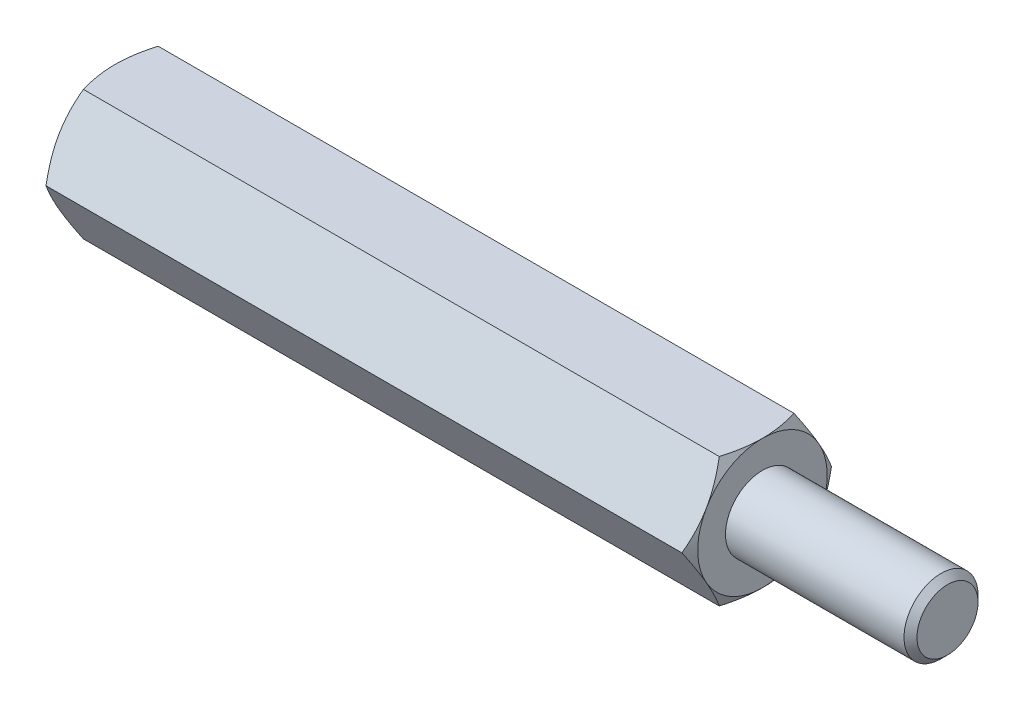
ISO-10303-21;
HEADER;
FILE_DESCRIPTION(('STEP AP214'),'2;1');
FILE_NAME('part.step','',(''),(''),'','','');
FILE_SCHEMA(('AUTOMOTIVE_DESIGN { 1 0 10303 214 1 1 1 1 }'));
ENDSEC;
DATA;
#1=APPLICATION_CONTEXT('core data for automotive mechanical design processes');
#2=APPLICATION_PROTOCOL_DEFINITION('international standard','automotive_design',2000,#1);
#3=PRODUCT_CONTEXT('',#1,'mechanical');
#4=PRODUCT('Part','Part','',(#3));
#5=PRODUCT_RELATED_PRODUCT_CATEGORY('part','',(#4));
#6=PRODUCT_DEFINITION_FORMATION('','',#4);
#7=PRODUCT_DEFINITION_CONTEXT('part definition',#1,'design');
#8=PRODUCT_DEFINITION('design','',#6,#7);
#9=PRODUCT_DEFINITION_SHAPE('','',#8);
#10=(LENGTH_UNIT() NAMED_UNIT(*) SI_UNIT(.MILLI.,.METRE.));
#11=(NAMED_UNIT(*) PLANE_ANGLE_UNIT() SI_UNIT($,.RADIAN.));
#12=(NAMED_UNIT(*) SI_UNIT($,.STERADIAN.) SOLID_ANGLE_UNIT());
#13=UNCERTAINTY_MEASURE_WITH_UNIT(LENGTH_MEASURE(1.E-05),#10,'distance_accuracy_value','');
#14=(GEOMETRIC_REPRESENTATION_CONTEXT(3) GLOBAL_UNCERTAINTY_ASSIGNED_CONTEXT((#13)) GLOBAL_UNIT_ASSIGNED_CONTEXT((#10,
#11,#12)) REPRESENTATION_CONTEXT('',''));
#15=CARTESIAN_POINT('',(0.,0.,0.));
#16=DIRECTION('',(0.,0.,1.));
#17=DIRECTION('',(1.,0.,0.));
#18=AXIS2_PLACEMENT_3D('',#15,#16,#17);
#19=CARTESIAN_POINT('',(17.5,3.5,-2.02072594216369));
#20=DIRECTION('',(1.,0.,0.));
#21=DIRECTION('',(0.,0.,-1.));
#22=AXIS2_PLACEMENT_3D('',#19,#20,#21);
#23=PLANE('',#22);
#24=CARTESIAN_POINT('',(17.5,0.,0.));
#25=DIRECTION('',(1.,0.,0.));
#26=DIRECTION('',(0.,0.,-1.));
#27=AXIS2_PLACEMENT_3D('',#24,#25,#26);
#28=CIRCLE('',#27,3.5);
#29=CARTESIAN_POINT('',(17.5,-1.75,-3.03108891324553));
#30=VERTEX_POINT('',#29);
#31=CARTESIAN_POINT('',(17.5,1.75,-3.03108891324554));
#32=VERTEX_POINT('',#31);
#33=EDGE_CURVE('E288',#30,#32,#28,.T.);
#34=ORIENTED_EDGE('',*,*,#33,.T.);
#35=CARTESIAN_POINT('',(17.5,3.5,0.));
#36=VERTEX_POINT('',#35);
#37=EDGE_CURVE('E53',#32,#36,#28,.T.);
#38=ORIENTED_EDGE('',*,*,#37,.T.);
#39=CARTESIAN_POINT('',(17.5,1.75,3.03108891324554));
#40=VERTEX_POINT('',#39);
#41=EDGE_CURVE('E297',#36,#40,#28,.T.);
#42=ORIENTED_EDGE('',*,*,#41,.T.);
#43=CARTESIAN_POINT('',(17.5,-1.75000000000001,3.03108891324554));
#44=VERTEX_POINT('',#43);
#45=EDGE_CURVE('E301',#40,#44,#28,.T.);
#46=ORIENTED_EDGE('',*,*,#45,.T.);
#47=CARTESIAN_POINT('',(17.5,0.,0.));
#48=DIRECTION('',(-1.,0.,0.));
#49=DIRECTION('',(0.,-1.,0.));
#50=AXIS2_PLACEMENT_3D('',#47,#48,#49);
#51=CIRCLE('',#50,3.5);
#52=CARTESIAN_POINT('',(17.5,-3.50000000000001,0.));
#53=VERTEX_POINT('',#52);
#54=EDGE_CURVE('E193',#53,#44,#51,.T.);
#55=ORIENTED_EDGE('',*,*,#54,.F.);
#56=EDGE_CURVE('E61',#53,#30,#28,.T.);
#57=ORIENTED_EDGE('',*,*,#56,.T.);
#58=EDGE_LOOP('',(#34,#38,#42,#46,#55,#57));
#59=FACE_BOUND('',#58,.T.);
#60=CARTESIAN_POINT('',(17.5,0.,0.));
#61=DIRECTION('',(1.,0.,0.));
#62=DIRECTION('',(0.,0.,-1.));
#63=AXIS2_PLACEMENT_3D('',#60,#61,#62);
#64=CIRCLE('',#63,2.);
#65=CARTESIAN_POINT('',(17.5,0.,-2.));
#66=VERTEX_POINT('',#65);
#67=EDGE_CURVE('E339',#66,#66,#64,.T.);
#68=ORIENTED_EDGE('',*,*,#67,.F.);
#69=EDGE_LOOP('',(#68));
#70=FACE_BOUND('',#69,.T.);
#71=ADVANCED_FACE('F37',(#59,#70),#23,.T.);
#72=CARTESIAN_POINT('',(17.5,0.,-4.04145188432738));
#73=DIRECTION('',(0.,-0.5,0.866025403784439));
#74=DIRECTION('',(0.,-0.866025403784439,-0.5));
#75=AXIS2_PLACEMENT_3D('',#72,#73,#74);
#76=PLANE('',#75);
#77=CARTESIAN_POINT('',(17.1873259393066,-0.000200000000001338,-4.04156735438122));
#78=CARTESIAN_POINT('',(17.23861421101,0.153607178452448,-3.9527667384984));
#79=CARTESIAN_POINT('',(17.2852590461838,0.308742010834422,-3.86319960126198));
#80=CARTESIAN_POINT('',(17.3666781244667,0.621698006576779,-3.68251437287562));
#81=CARTESIAN_POINT('',(17.4014235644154,0.779524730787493,-3.59139307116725));
#82=CARTESIAN_POINT('',(17.4555099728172,1.09322221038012,-3.41027974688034));
#83=CARTESIAN_POINT('',(17.4752109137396,1.24904469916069,-3.32031559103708));
#84=CARTESIAN_POINT('',(17.4987298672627,1.56142288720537,-3.13996396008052));
#85=CARTESIAN_POINT('',(17.5025673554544,1.71797745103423,-3.04957714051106));
#86=CARTESIAN_POINT('',(17.494584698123,2.01050921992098,-2.88068384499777));
#87=CARTESIAN_POINT('',(17.4847245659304,2.1465302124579,-2.80215208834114));
#88=CARTESIAN_POINT('',(17.4534735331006,2.41768602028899,-2.64560020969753));
#89=CARTESIAN_POINT('',(17.4320719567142,2.55281989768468,-2.5675806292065));
#90=CARTESIAN_POINT('',(17.3785695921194,2.82453479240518,-2.41070596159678));
#91=CARTESIAN_POINT('',(17.3462420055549,2.96108141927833,-2.33187072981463));
#92=CARTESIAN_POINT('',(17.272871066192,3.2321380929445,-2.17537608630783));
#93=CARTESIAN_POINT('',(17.2318449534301,3.36665161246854,-2.09771466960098));
#94=CARTESIAN_POINT('',(17.1873259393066,3.5002,-2.02061047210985));
#95=B_SPLINE_CURVE_WITH_KNOTS('',3,(#77,#78,#79,#80,#81,#82,#83,#84,#85,#86,#87,#88,#89,#90,#91,
#92,#93,#94),.UNSPECIFIED.,.F.,.F.,(4,2,2,2,2,2,2,2,4),(0.,0.554793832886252,1.11092123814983,
1.65328467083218,2.19498204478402,2.6666513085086,3.13875761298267,3.62133612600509,
4.10296698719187),.UNSPECIFIED.);
#96=CARTESIAN_POINT('',(17.1873926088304,0.,-4.04145188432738));
#97=VERTEX_POINT('',#96);
#98=EDGE_CURVE('E350',#97,#32,#95,.T.);
#99=ORIENTED_EDGE('',*,*,#98,.F.);
#100=DIRECTION('',(-1.,0.,0.));
#101=VECTOR('',#100,1.);
#102=CARTESIAN_POINT('',(17.5,0.,-4.04145188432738));
#103=LINE('',#102,#101);
#104=CARTESIAN_POINT('',(-17.1873926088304,0.,-4.04145188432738));
#105=VERTEX_POINT('',#104);
#106=EDGE_CURVE('E264',#97,#105,#103,.T.);
#107=ORIENTED_EDGE('',*,*,#106,.T.);
#108=CARTESIAN_POINT('',(-17.1873259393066,3.5002,-2.02061047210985));
#109=CARTESIAN_POINT('',(-17.23861421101,3.34639282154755,-2.10941108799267));
#110=CARTESIAN_POINT('',(-17.2852590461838,3.19125798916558,-2.19897822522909));
#111=CARTESIAN_POINT('',(-17.3666781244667,2.87830199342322,-2.37966345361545));
#112=CARTESIAN_POINT('',(-17.4014235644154,2.72047526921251,-2.47078475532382));
#113=CARTESIAN_POINT('',(-17.4555099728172,2.40677778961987,-2.65189807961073));
#114=CARTESIAN_POINT('',(-17.4752109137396,2.25095530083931,-2.74186223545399));
#115=CARTESIAN_POINT('',(-17.4987298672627,1.93857711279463,-2.92221386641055));
#116=CARTESIAN_POINT('',(-17.5025673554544,1.78202254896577,-3.01260068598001));
#117=CARTESIAN_POINT('',(-17.494584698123,1.48949078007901,-3.1814939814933));
#118=CARTESIAN_POINT('',(-17.4847245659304,1.3534697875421,-3.26002573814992));
#119=CARTESIAN_POINT('',(-17.4534735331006,1.08231397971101,-3.41657761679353));
#120=CARTESIAN_POINT('',(-17.4320719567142,0.947180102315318,-3.49459719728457));
#121=CARTESIAN_POINT('',(-17.3785695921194,0.675465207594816,-3.65147186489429));
#122=CARTESIAN_POINT('',(-17.3462420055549,0.538918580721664,-3.73030709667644));
#123=CARTESIAN_POINT('',(-17.272871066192,0.267861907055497,-3.88680174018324));
#124=CARTESIAN_POINT('',(-17.2318449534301,0.133348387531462,-3.96446315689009));
#125=CARTESIAN_POINT('',(-17.1873259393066,-0.000200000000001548,-4.04156735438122));
#126=B_SPLINE_CURVE_WITH_KNOTS('',3,(#108,#109,#110,#111,#112,#113,#114,#115,#116,#117,#118,
#119,#120,#121,#122,#123,#124,#125),.UNSPECIFIED.,.F.,.F.,(4,2,2,2,2,2,2,2,4),(0.,
0.554793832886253,1.11092123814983,1.65328467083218,2.19498204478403,2.6666513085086,
3.13875761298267,3.6213361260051,4.10296698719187),.UNSPECIFIED.);
#127=CARTESIAN_POINT('',(-17.5,1.75,-3.03108891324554));
#128=VERTEX_POINT('',#127);
#129=EDGE_CURVE('E317',#128,#105,#126,.T.);
#130=ORIENTED_EDGE('',*,*,#129,.F.);
#131=CARTESIAN_POINT('',(-17.1873926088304,3.5,-2.02072594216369));
#132=VERTEX_POINT('',#131);
#133=EDGE_CURVE('E320',#132,#128,#126,.T.);
#134=ORIENTED_EDGE('',*,*,#133,.F.);
#135=DIRECTION('',(-1.,0.,0.));
#136=VECTOR('',#135,1.);
#137=CARTESIAN_POINT('',(17.5,3.5,-2.02072594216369));
#138=LINE('',#137,#136);
#139=CARTESIAN_POINT('',(17.1873926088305,3.5,-2.02072594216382));
#140=VERTEX_POINT('',#139);
#141=EDGE_CURVE('E279',#140,#132,#138,.T.);
#142=ORIENTED_EDGE('',*,*,#141,.F.);
#143=EDGE_CURVE('E229',#32,#140,#95,.T.);
#144=ORIENTED_EDGE('',*,*,#143,.F.);
#145=EDGE_LOOP('',(#99,#107,#130,#134,#142,#144));
#146=FACE_BOUND('',#145,.T.);
#147=ADVANCED_FACE('F148',(#146),#76,.F.);
#148=CARTESIAN_POINT('',(17.5,3.5,-2.02072594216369));
#149=DIRECTION('',(0.,-1.,0.));
#150=DIRECTION('',(0.,0.,-1.));
#151=AXIS2_PLACEMENT_3D('',#148,#149,#150);
#152=PLANE('',#151);
#153=CARTESIAN_POINT('',(15.7443294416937,3.5,-5.525713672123));
#154=CARTESIAN_POINT('',(15.8192813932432,3.5,-5.37200190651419));
#155=CARTESIAN_POINT('',(15.893542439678,3.5,-5.21794762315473));
#156=CARTESIAN_POINT('',(16.0402960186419,3.5,-4.90897223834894));
#157=CARTESIAN_POINT('',(16.1127882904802,3.5,-4.75405101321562));
#158=CARTESIAN_POINT('',(16.2559617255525,3.5,-4.44240758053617));
#159=CARTESIAN_POINT('',(16.3266316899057,3.5,-4.28568021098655));
#160=CARTESIAN_POINT('',(16.4652074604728,3.5,-3.97101270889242));
#161=CARTESIAN_POINT('',(16.5331133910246,3.5,-3.81307263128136));
#162=CARTESIAN_POINT('',(16.6677143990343,3.5,-3.49026114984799));
#163=CARTESIAN_POINT('',(16.7342871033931,3.5,-3.32533845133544));
#164=CARTESIAN_POINT('',(16.8626267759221,3.5,-2.99359992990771));
#165=CARTESIAN_POINT('',(16.9243932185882,3.5,-2.82678390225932));
#166=CARTESIAN_POINT('',(17.0415700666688,3.5,-2.49127529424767));
#167=CARTESIAN_POINT('',(17.0969925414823,3.5,-2.32258697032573));
#168=CARTESIAN_POINT('',(17.1997679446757,3.5,-1.98279215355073));
#169=CARTESIAN_POINT('',(17.2471233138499,3.5,-1.81168640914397));
#170=CARTESIAN_POINT('',(17.3312987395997,3.5,-1.46793354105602));
#171=CARTESIAN_POINT('',(17.3681796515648,3.5,-1.2953015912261));
#172=CARTESIAN_POINT('',(17.4293955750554,3.5,-0.947791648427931));
#173=CARTESIAN_POINT('',(17.453731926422,3.5,-0.77291389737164));
#174=CARTESIAN_POINT('',(17.4876038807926,3.5,-0.424108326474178));
#175=CARTESIAN_POINT('',(17.497337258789,3.5,-0.250200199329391));
#176=CARTESIAN_POINT('',(17.5017053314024,3.5,0.0978233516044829));
#177=CARTESIAN_POINT('',(17.4963399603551,3.5,0.271938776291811));
#178=CARTESIAN_POINT('',(17.4750118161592,3.5,0.564711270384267));
#179=CARTESIAN_POINT('',(17.4628919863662,3.5,0.683667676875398));
#180=CARTESIAN_POINT('',(17.4323080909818,3.5,0.920767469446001));
#181=CARTESIAN_POINT('',(17.4138432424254,3.5,1.03891075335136));
#182=CARTESIAN_POINT('',(17.3498956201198,3.5,1.39193174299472));
#183=CARTESIAN_POINT('',(17.2958695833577,3.5,1.62528232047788));
#184=CARTESIAN_POINT('',(17.2014515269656,3.5,1.97433825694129));
#185=CARTESIAN_POINT('',(17.1672900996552,3.5,2.09183268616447));
#186=CARTESIAN_POINT('',(17.095234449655,3.5,2.32568238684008));
#187=CARTESIAN_POINT('',(17.0573401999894,3.5,2.44203765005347));
#188=CARTESIAN_POINT('',(16.9784421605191,3.5,2.6736423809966));
#189=CARTESIAN_POINT('',(16.9374392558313,3.5,2.78889215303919));
#190=CARTESIAN_POINT('',(16.852824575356,3.5,3.0184246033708));
#191=CARTESIAN_POINT('',(16.8092128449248,3.5,3.13270729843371));
#192=CARTESIAN_POINT('',(16.6958241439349,3.5,3.42150510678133));
#193=CARTESIAN_POINT('',(16.6245636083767,3.5,3.59543696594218));
#194=CARTESIAN_POINT('',(16.4781026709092,3.5,3.94163961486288));
#195=CARTESIAN_POINT('',(16.4029019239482,3.5,4.11391025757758));
#196=CARTESIAN_POINT('',(16.2494252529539,3.5,4.45713072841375));
#197=CARTESIAN_POINT('',(16.1711484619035,3.5,4.62808016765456));
#198=CARTESIAN_POINT('',(16.012188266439,3.5,4.96885843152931));
#199=CARTESIAN_POINT('',(15.9315047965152,3.5,5.13868722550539));
#200=CARTESIAN_POINT('',(15.6863871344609,3.5,5.64726192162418));
#201=CARTESIAN_POINT('',(15.5190975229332,3.5,5.98463020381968));
#202=CARTESIAN_POINT('',(15.1795854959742,3.5,6.65678495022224));
#203=CARTESIAN_POINT('',(15.0073639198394,3.5,6.99157184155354));
#204=CARTESIAN_POINT('',(14.6760800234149,3.5,7.62749570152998));
#205=CARTESIAN_POINT('',(14.5173299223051,3.5,7.92879562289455));
#206=CARTESIAN_POINT('',(14.1977473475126,3.5,8.53030635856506));
#207=CARTESIAN_POINT('',(14.0369147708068,3.5,8.83051711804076));
#208=CARTESIAN_POINT('',(13.7141792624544,3.5,9.42918006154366));
#209=CARTESIAN_POINT('',(13.5522810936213,3.5,9.72763481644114));
#210=CARTESIAN_POINT('',(13.2272737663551,3.5,10.3238577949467));
#211=CARTESIAN_POINT('',(13.0641646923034,3.5,10.6216260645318));
#212=CARTESIAN_POINT('',(12.9006104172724,3.5,10.9191478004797));
#213=B_SPLINE_CURVE_WITH_KNOTS('',3,(#153,#154,#155,#156,#157,#158,#159,#160,#161,#162,#163,
#164,#165,#166,#167,#168,#169,#170,#171,#172,#173,#174,#175,#176,#177,#178,#179,#180,#181,#182,
#183,#184,#185,#186,#187,#188,#189,#190,#191,#192,#193,#194,#195,#196,#197,#198,#199,#200,#201,
#202,#203,#204,#205,#206,#207,#208,#209,#210,#211,#212),.UNSPECIFIED.,.F.,.F.,(4,2,2,2,2,2,2,2,
2,2,2,2,2,2,2,2,2,2,2,2,2,2,2,2,2,2,2,2,2,4),(0.,0.513041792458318,1.02615874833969,
1.5419080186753,2.05763406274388,2.59113284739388,3.1246898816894,3.65721433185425,
4.18957737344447,4.71878103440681,5.247928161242,5.76984197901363,6.29175806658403,
6.65030258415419,7.00889136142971,7.72642330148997,8.0934692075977,8.46051776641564,
8.82746220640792,9.19440026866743,9.75822236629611,10.3220939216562,10.8861255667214,
11.4501725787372,12.579801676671,13.7092396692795,14.730918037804,15.7526471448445,
16.771258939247,17.7898004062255),.UNSPECIFIED.);
#214=EDGE_CURVE('E227',#140,#36,#213,.T.);
#215=ORIENTED_EDGE('',*,*,#214,.F.);
#216=ORIENTED_EDGE('',*,*,#141,.T.);
#217=CARTESIAN_POINT('',(-15.7443294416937,3.5,-5.525713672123));
#218=CARTESIAN_POINT('',(-15.8192813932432,3.5,-5.37200190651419));
#219=CARTESIAN_POINT('',(-15.893542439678,3.5,-5.21794762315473));
#220=CARTESIAN_POINT('',(-16.0402960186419,3.5,-4.90897223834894));
#221=CARTESIAN_POINT('',(-16.1127882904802,3.5,-4.75405101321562));
#222=CARTESIAN_POINT('',(-16.2559617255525,3.5,-4.44240758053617));
#223=CARTESIAN_POINT('',(-16.3266316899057,3.5,-4.28568021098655));
#224=CARTESIAN_POINT('',(-16.4652074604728,3.5,-3.97101270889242));
#225=CARTESIAN_POINT('',(-16.5331133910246,3.5,-3.81307263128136));
#226=CARTESIAN_POINT('',(-16.6677143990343,3.5,-3.49026114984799));
#227=CARTESIAN_POINT('',(-16.7342871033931,3.5,-3.32533845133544));
#228=CARTESIAN_POINT('',(-16.8626267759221,3.5,-2.99359992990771));
#229=CARTESIAN_POINT('',(-16.9243932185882,3.5,-2.82678390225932));
#230=CARTESIAN_POINT('',(-17.0415700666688,3.5,-2.49127529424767));
#231=CARTESIAN_POINT('',(-17.0969925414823,3.5,-2.32258697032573));
#232=CARTESIAN_POINT('',(-17.1997679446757,3.5,-1.98279215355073));
#233=CARTESIAN_POINT('',(-17.2471233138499,3.5,-1.81168640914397));
#234=CARTESIAN_POINT('',(-17.3312987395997,3.5,-1.46793354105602));
#235=CARTESIAN_POINT('',(-17.3681796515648,3.5,-1.2953015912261));
#236=CARTESIAN_POINT('',(-17.4293955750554,3.5,-0.947791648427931));
#237=CARTESIAN_POINT('',(-17.453731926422,3.5,-0.77291389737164));
#238=CARTESIAN_POINT('',(-17.4876038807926,3.5,-0.424108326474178));
#239=CARTESIAN_POINT('',(-17.497337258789,3.5,-0.250200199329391));
#240=CARTESIAN_POINT('',(-17.5017053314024,3.5,0.0978233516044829));
#241=CARTESIAN_POINT('',(-17.4963399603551,3.5,0.271938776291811));
#242=CARTESIAN_POINT('',(-17.4750118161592,3.5,0.564711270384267));
#243=CARTESIAN_POINT('',(-17.4628919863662,3.5,0.683667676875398));
#244=CARTESIAN_POINT('',(-17.4323080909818,3.5,0.920767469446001));
#245=CARTESIAN_POINT('',(-17.4138432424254,3.5,1.03891075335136));
#246=CARTESIAN_POINT('',(-17.3498956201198,3.5,1.39193174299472));
#247=CARTESIAN_POINT('',(-17.2958695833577,3.5,1.62528232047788));
#248=CARTESIAN_POINT('',(-17.2014515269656,3.5,1.97433825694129));
#249=CARTESIAN_POINT('',(-17.1672900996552,3.5,2.09183268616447));
#250=CARTESIAN_POINT('',(-17.095234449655,3.5,2.32568238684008));
#251=CARTESIAN_POINT('',(-17.0573401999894,3.5,2.44203765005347));
#252=CARTESIAN_POINT('',(-16.9784421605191,3.5,2.6736423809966));
#253=CARTESIAN_POINT('',(-16.9374392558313,3.5,2.78889215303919));
#254=CARTESIAN_POINT('',(-16.852824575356,3.5,3.0184246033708));
#255=CARTESIAN_POINT('',(-16.8092128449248,3.5,3.13270729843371));
#256=CARTESIAN_POINT('',(-16.6958241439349,3.5,3.42150510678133));
#257=CARTESIAN_POINT('',(-16.6245636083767,3.5,3.59543696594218));
#258=CARTESIAN_POINT('',(-16.4781026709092,3.5,3.94163961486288));
#259=CARTESIAN_POINT('',(-16.4029019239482,3.5,4.11391025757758));
#260=CARTESIAN_POINT('',(-16.2494252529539,3.5,4.45713072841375));
#261=CARTESIAN_POINT('',(-16.1711484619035,3.5,4.62808016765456));
#262=CARTESIAN_POINT('',(-16.012188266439,3.5,4.96885843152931));
#263=CARTESIAN_POINT('',(-15.9315047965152,3.5,5.13868722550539));
#264=CARTESIAN_POINT('',(-15.6863871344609,3.5,5.64726192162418));
#265=CARTESIAN_POINT('',(-15.5190975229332,3.5,5.98463020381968));
#266=CARTESIAN_POINT('',(-15.1795854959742,3.5,6.65678495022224));
#267=CARTESIAN_POINT('',(-15.0073639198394,3.5,6.99157184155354));
#268=CARTESIAN_POINT('',(-14.6760800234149,3.5,7.62749570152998));
#269=CARTESIAN_POINT('',(-14.5173299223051,3.5,7.92879562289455));
#270=CARTESIAN_POINT('',(-14.1977473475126,3.5,8.53030635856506));
#271=CARTESIAN_POINT('',(-14.0369147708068,3.5,8.83051711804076));
#272=CARTESIAN_POINT('',(-13.7141792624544,3.5,9.42918006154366));
#273=CARTESIAN_POINT('',(-13.5522810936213,3.5,9.72763481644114));
#274=CARTESIAN_POINT('',(-13.2272737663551,3.5,10.3238577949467));
#275=CARTESIAN_POINT('',(-13.0641646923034,3.5,10.6216260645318));
#276=CARTESIAN_POINT('',(-12.9006104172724,3.5,10.9191478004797));
#277=B_SPLINE_CURVE_WITH_KNOTS('',3,(#217,#218,#219,#220,#221,#222,#223,#224,#225,#226,#227,
#228,#229,#230,#231,#232,#233,#234,#235,#236,#237,#238,#239,#240,#241,#242,#243,#244,#245,#246,
#247,#248,#249,#250,#251,#252,#253,#254,#255,#256,#257,#258,#259,#260,#261,#262,#263,#264,#265,
#266,#267,#268,#269,#270,#271,#272,#273,#274,#275,#276),.UNSPECIFIED.,.F.,.F.,(4,2,2,2,2,2,2,2,
2,2,2,2,2,2,2,2,2,2,2,2,2,2,2,2,2,2,2,2,2,4),(0.,0.513041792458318,1.02615874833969,
1.5419080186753,2.05763406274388,2.59113284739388,3.1246898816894,3.65721433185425,
4.18957737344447,4.71878103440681,5.247928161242,5.76984197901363,6.29175806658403,
6.65030258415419,7.00889136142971,7.72642330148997,8.0934692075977,8.46051776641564,
8.82746220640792,9.19440026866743,9.75822236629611,10.3220939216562,10.8861255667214,
11.4501725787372,12.579801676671,13.7092396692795,14.730918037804,15.7526471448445,
16.771258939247,17.7898004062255),.UNSPECIFIED.);
#278=CARTESIAN_POINT('',(-17.5,3.5,0.));
#279=VERTEX_POINT('',#278);
#280=EDGE_CURVE('E241',#279,#132,#277,.F.);
#281=ORIENTED_EDGE('',*,*,#280,.F.);
#282=CARTESIAN_POINT('',(-17.1873926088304,3.5,2.02072594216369));
#283=VERTEX_POINT('',#282);
#284=EDGE_CURVE('E249',#283,#279,#277,.F.);
#285=ORIENTED_EDGE('',*,*,#284,.F.);
#286=DIRECTION('',(-1.,0.,0.));
#287=VECTOR('',#286,1.);
#288=CARTESIAN_POINT('',(17.5,3.5,2.02072594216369));
#289=LINE('',#288,#287);
#290=CARTESIAN_POINT('',(17.1873926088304,3.5,2.02072594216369));
#291=VERTEX_POINT('',#290);
#292=EDGE_CURVE('E276',#291,#283,#289,.T.);
#293=ORIENTED_EDGE('',*,*,#292,.F.);
#294=EDGE_CURVE('E221',#36,#291,#213,.T.);
#295=ORIENTED_EDGE('',*,*,#294,.F.);
#296=EDGE_LOOP('',(#215,#216,#281,#285,#293,#295));
#297=FACE_BOUND('',#296,.T.);
#298=ADVANCED_FACE('F153',(#297),#152,.F.);
#299=CARTESIAN_POINT('',(17.5,3.5,2.02072594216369));
#300=DIRECTION('',(0.,-0.5,-0.866025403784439));
#301=DIRECTION('',(0.,0.866025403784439,-0.5));
#302=AXIS2_PLACEMENT_3D('',#299,#300,#301);
#303=PLANE('',#302);
#304=CARTESIAN_POINT('',(17.1873259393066,3.5002,2.02061047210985));
#305=CARTESIAN_POINT('',(17.23861421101,3.34639282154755,2.10941108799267));
#306=CARTESIAN_POINT('',(17.2852590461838,3.19125798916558,2.19897822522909));
#307=CARTESIAN_POINT('',(17.3666781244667,2.87830199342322,2.37966345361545));
#308=CARTESIAN_POINT('',(17.4014235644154,2.7204752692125,2.47078475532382));
#309=CARTESIAN_POINT('',(17.4555099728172,2.40677778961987,2.65189807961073));
#310=CARTESIAN_POINT('',(17.4752109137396,2.25095530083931,2.74186223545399));
#311=CARTESIAN_POINT('',(17.4987298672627,1.93857711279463,2.92221386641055));
#312=CARTESIAN_POINT('',(17.5025673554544,1.78202254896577,3.01260068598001));
#313=CARTESIAN_POINT('',(17.494584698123,1.48949078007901,3.1814939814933));
#314=CARTESIAN_POINT('',(17.4847245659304,1.35346978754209,3.26002573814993));
#315=CARTESIAN_POINT('',(17.4534735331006,1.08231397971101,3.41657761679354));
#316=CARTESIAN_POINT('',(17.4320719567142,0.947180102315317,3.49459719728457));
#317=CARTESIAN_POINT('',(17.3785695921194,0.675465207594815,3.65147186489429));
#318=CARTESIAN_POINT('',(17.3462420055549,0.538918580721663,3.73030709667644));
#319=CARTESIAN_POINT('',(17.272871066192,0.267861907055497,3.88680174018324));
#320=CARTESIAN_POINT('',(17.2318449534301,0.133348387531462,3.96446315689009));
#321=CARTESIAN_POINT('',(17.1873259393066,-0.000200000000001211,4.04156735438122));
#322=B_SPLINE_CURVE_WITH_KNOTS('',3,(#304,#305,#306,#307,#308,#309,#310,#311,#312,#313,#314,
#315,#316,#317,#318,#319,#320,#321),.UNSPECIFIED.,.F.,.F.,(4,2,2,2,2,2,2,2,4),(0.,
0.554793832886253,1.11092123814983,1.65328467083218,2.19498204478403,2.6666513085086,
3.13875761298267,3.62133612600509,4.10296698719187),.UNSPECIFIED.);
#323=EDGE_CURVE('E228',#291,#40,#322,.T.);
#324=ORIENTED_EDGE('',*,*,#323,.F.);
#325=ORIENTED_EDGE('',*,*,#292,.T.);
#326=CARTESIAN_POINT('',(-17.1873259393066,-0.000200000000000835,4.04156735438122));
#327=CARTESIAN_POINT('',(-17.23861421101,0.153607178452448,3.9527667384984));
#328=CARTESIAN_POINT('',(-17.2852590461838,0.308742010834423,3.86319960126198));
#329=CARTESIAN_POINT('',(-17.3666781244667,0.621698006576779,3.68251437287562));
#330=CARTESIAN_POINT('',(-17.4014235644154,0.779524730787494,3.59139307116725));
#331=CARTESIAN_POINT('',(-17.4555099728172,1.09322221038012,3.41027974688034));
#332=CARTESIAN_POINT('',(-17.4752109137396,1.24904469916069,3.32031559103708));
#333=CARTESIAN_POINT('',(-17.4987298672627,1.56142288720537,3.13996396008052));
#334=CARTESIAN_POINT('',(-17.5025673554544,1.71797745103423,3.04957714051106));
#335=CARTESIAN_POINT('',(-17.494584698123,2.01050921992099,2.88068384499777));
#336=CARTESIAN_POINT('',(-17.4847245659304,2.1465302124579,2.80215208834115));
#337=CARTESIAN_POINT('',(-17.4534735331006,2.41768602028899,2.64560020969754));
#338=CARTESIAN_POINT('',(-17.4320719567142,2.55281989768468,2.5675806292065));
#339=CARTESIAN_POINT('',(-17.3785695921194,2.82453479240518,2.41070596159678));
#340=CARTESIAN_POINT('',(-17.3462420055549,2.96108141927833,2.33187072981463));
#341=CARTESIAN_POINT('',(-17.272871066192,3.2321380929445,2.17537608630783));
#342=CARTESIAN_POINT('',(-17.2318449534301,3.36665161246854,2.09771466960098));
#343=CARTESIAN_POINT('',(-17.1873259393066,3.5002,2.02061047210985));
#344=B_SPLINE_CURVE_WITH_KNOTS('',3,(#326,#327,#328,#329,#330,#331,#332,#333,#334,#335,#336,
#337,#338,#339,#340,#341,#342,#343),.UNSPECIFIED.,.F.,.F.,(4,2,2,2,2,2,2,2,4),(0.,
0.554793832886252,1.11092123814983,1.65328467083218,2.19498204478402,2.66665130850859,
3.13875761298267,3.62133612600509,4.10296698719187),.UNSPECIFIED.);
#345=CARTESIAN_POINT('',(-17.5,1.75,3.03108891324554));
#346=VERTEX_POINT('',#345);
#347=EDGE_CURVE('E255',#346,#283,#344,.T.);
#348=ORIENTED_EDGE('',*,*,#347,.F.);
#349=CARTESIAN_POINT('',(-17.1873926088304,0.,4.04145188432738));
#350=VERTEX_POINT('',#349);
#351=EDGE_CURVE('E262',#350,#346,#344,.T.);
#352=ORIENTED_EDGE('',*,*,#351,.F.);
#353=DIRECTION('',(-1.,0.,0.));
#354=VECTOR('',#353,1.);
#355=CARTESIAN_POINT('',(17.5,0.,4.04145188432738));
#356=LINE('',#355,#354);
#357=CARTESIAN_POINT('',(17.1873926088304,0.,4.04145188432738));
#358=VERTEX_POINT('',#357);
#359=EDGE_CURVE('E273',#358,#350,#356,.T.);
#360=ORIENTED_EDGE('',*,*,#359,.F.);
#361=EDGE_CURVE('E215',#40,#358,#322,.T.);
#362=ORIENTED_EDGE('',*,*,#361,.F.);
#363=EDGE_LOOP('',(#324,#325,#348,#352,#360,#362));
#364=FACE_BOUND('',#363,.T.);
#365=ADVANCED_FACE('F235',(#364),#303,.F.);
#366=CARTESIAN_POINT('',(17.5,0.,4.04145188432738));
#367=DIRECTION('',(0.,0.5,-0.866025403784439));
#368=DIRECTION('',(0.,0.866025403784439,0.5));
#369=AXIS2_PLACEMENT_3D('',#366,#367,#368);
#370=PLANE('',#369);
#371=CARTESIAN_POINT('',(17.1873259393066,0.000199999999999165,4.04156735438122));
#372=CARTESIAN_POINT('',(17.23861421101,-0.15360717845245,3.9527667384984));
#373=CARTESIAN_POINT('',(17.2852590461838,-0.308742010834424,3.86319960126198));
#374=CARTESIAN_POINT('',(17.3666781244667,-0.621698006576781,3.68251437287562));
#375=CARTESIAN_POINT('',(17.4014235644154,-0.779524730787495,3.59139307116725));
#376=CARTESIAN_POINT('',(17.4555099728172,-1.09322221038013,3.41027974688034));
#377=CARTESIAN_POINT('',(17.4752109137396,-1.24904469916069,3.32031559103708));
#378=CARTESIAN_POINT('',(17.4987298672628,-1.56142288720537,3.13996396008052));
#379=CARTESIAN_POINT('',(17.5025673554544,-1.71797745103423,3.04957714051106));
#380=CARTESIAN_POINT('',(17.494584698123,-2.01050921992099,2.88068384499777));
#381=CARTESIAN_POINT('',(17.4847245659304,-2.1465302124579,2.80215208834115));
#382=CARTESIAN_POINT('',(17.4534735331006,-2.41768602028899,2.64560020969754));
#383=CARTESIAN_POINT('',(17.4320719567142,-2.55281989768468,2.5675806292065));
#384=CARTESIAN_POINT('',(17.3785695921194,-2.82453479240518,2.41070596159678));
#385=CARTESIAN_POINT('',(17.3462420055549,-2.96108141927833,2.33187072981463));
#386=CARTESIAN_POINT('',(17.272871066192,-3.2321380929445,2.17537608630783));
#387=CARTESIAN_POINT('',(17.2318449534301,-3.36665161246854,2.09771466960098));
#388=CARTESIAN_POINT('',(17.1873259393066,-3.5002,2.02061047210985));
#389=B_SPLINE_CURVE_WITH_KNOTS('',3,(#371,#372,#373,#374,#375,#376,#377,#378,#379,#380,#381,
#382,#383,#384,#385,#386,#387,#388),.UNSPECIFIED.,.F.,.F.,(4,2,2,2,2,2,2,2,4),(0.,
0.554793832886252,1.11092123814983,1.65328467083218,2.19498204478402,2.66665130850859,
3.13875761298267,3.62133612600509,4.10296698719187),.UNSPECIFIED.);
#390=EDGE_CURVE('E324',#358,#44,#389,.T.);
#391=ORIENTED_EDGE('',*,*,#390,.F.);
#392=ORIENTED_EDGE('',*,*,#359,.T.);
#393=CARTESIAN_POINT('',(-17.1873259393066,-3.5002,2.02061047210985));
#394=CARTESIAN_POINT('',(-17.23861421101,-3.34639282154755,2.10941108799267));
#395=CARTESIAN_POINT('',(-17.2852590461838,-3.19125798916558,2.19897822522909));
#396=CARTESIAN_POINT('',(-17.3666781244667,-2.87830199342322,2.37966345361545));
#397=CARTESIAN_POINT('',(-17.4014235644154,-2.72047526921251,2.47078475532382));
#398=CARTESIAN_POINT('',(-17.4555099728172,-2.40677778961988,2.65189807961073));
#399=CARTESIAN_POINT('',(-17.4752109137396,-2.25095530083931,2.74186223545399));
#400=CARTESIAN_POINT('',(-17.4987298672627,-1.93857711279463,2.92221386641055));
#401=CARTESIAN_POINT('',(-17.5025673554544,-1.78202254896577,3.01260068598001));
#402=CARTESIAN_POINT('',(-17.494584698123,-1.48949078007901,3.1814939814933));
#403=CARTESIAN_POINT('',(-17.4847245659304,-1.3534697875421,3.26002573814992));
#404=CARTESIAN_POINT('',(-17.4534735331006,-1.08231397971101,3.41657761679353));
#405=CARTESIAN_POINT('',(-17.4320719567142,-0.94718010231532,3.49459719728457));
#406=CARTESIAN_POINT('',(-17.3785695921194,-0.675465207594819,3.65147186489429));
#407=CARTESIAN_POINT('',(-17.3462420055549,-0.538918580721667,3.73030709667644));
#408=CARTESIAN_POINT('',(-17.272871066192,-0.2678619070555,3.88680174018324));
#409=CARTESIAN_POINT('',(-17.2318449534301,-0.133348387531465,3.96446315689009));
#410=CARTESIAN_POINT('',(-17.1873259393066,0.000199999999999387,4.04156735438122));
#411=B_SPLINE_CURVE_WITH_KNOTS('',3,(#393,#394,#395,#396,#397,#398,#399,#400,#401,#402,#403,
#404,#405,#406,#407,#408,#409,#410),.UNSPECIFIED.,.F.,.F.,(4,2,2,2,2,2,2,2,4),(0.,
0.554793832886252,1.11092123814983,1.65328467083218,2.19498204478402,2.66665130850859,
3.13875761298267,3.62133612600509,4.10296698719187),.UNSPECIFIED.);
#412=CARTESIAN_POINT('',(-17.5,-1.75000000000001,3.03108891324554));
#413=VERTEX_POINT('',#412);
#414=EDGE_CURVE('E263',#413,#350,#411,.T.);
#415=ORIENTED_EDGE('',*,*,#414,.F.);
#416=CARTESIAN_POINT('',(-17.1873926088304,-3.5,2.02072594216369));
#417=VERTEX_POINT('',#416);
#418=EDGE_CURVE('E250',#417,#413,#411,.T.);
#419=ORIENTED_EDGE('',*,*,#418,.F.);
#420=DIRECTION('',(-1.,0.,0.));
#421=VECTOR('',#420,1.);
#422=CARTESIAN_POINT('',(17.5,-3.5,2.02072594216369));
#423=LINE('',#422,#421);
#424=CARTESIAN_POINT('',(17.1873926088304,-3.5,2.02072594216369));
#425=VERTEX_POINT('',#424);
#426=EDGE_CURVE('E270',#425,#417,#423,.T.);
#427=ORIENTED_EDGE('',*,*,#426,.F.);
#428=EDGE_CURVE('E210',#44,#425,#389,.T.);
#429=ORIENTED_EDGE('',*,*,#428,.F.);
#430=EDGE_LOOP('',(#391,#392,#415,#419,#427,#429));
#431=FACE_BOUND('',#430,.T.);
#432=ADVANCED_FACE('F396',(#431),#370,.F.);
#433=CARTESIAN_POINT('',(17.5,-3.5,2.02072594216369));
#434=DIRECTION('',(0.,1.,0.));
#435=DIRECTION('',(0.,0.,1.));
#436=AXIS2_PLACEMENT_3D('',#433,#434,#435);
#437=PLANE('',#436);
#438=CARTESIAN_POINT('',(15.7443294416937,-3.5,-5.52571367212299));
#439=CARTESIAN_POINT('',(15.8192813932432,-3.5,-5.37200190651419));
#440=CARTESIAN_POINT('',(15.893542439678,-3.5,-5.21794762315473));
#441=CARTESIAN_POINT('',(16.0402960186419,-3.5,-4.90897223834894));
#442=CARTESIAN_POINT('',(16.1127882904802,-3.5,-4.75405101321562));
#443=CARTESIAN_POINT('',(16.2559617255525,-3.5,-4.44240758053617));
#444=CARTESIAN_POINT('',(16.3266316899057,-3.5,-4.28568021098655));
#445=CARTESIAN_POINT('',(16.4652074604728,-3.5,-3.97101270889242));
#446=CARTESIAN_POINT('',(16.5331133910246,-3.5,-3.81307263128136));
#447=CARTESIAN_POINT('',(16.6677143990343,-3.5,-3.49026114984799));
#448=CARTESIAN_POINT('',(16.7342871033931,-3.5,-3.32533845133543));
#449=CARTESIAN_POINT('',(16.8626267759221,-3.5,-2.99359992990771));
#450=CARTESIAN_POINT('',(16.9243932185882,-3.5,-2.82678390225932));
#451=CARTESIAN_POINT('',(17.0415700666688,-3.5,-2.49127529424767));
#452=CARTESIAN_POINT('',(17.0969925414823,-3.5,-2.32258697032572));
#453=CARTESIAN_POINT('',(17.1997679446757,-3.5,-1.98279215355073));
#454=CARTESIAN_POINT('',(17.2471233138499,-3.5,-1.81168640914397));
#455=CARTESIAN_POINT('',(17.3312987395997,-3.5,-1.46793354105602));
#456=CARTESIAN_POINT('',(17.3681796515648,-3.5,-1.2953015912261));
#457=CARTESIAN_POINT('',(17.4293955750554,-3.5,-0.947791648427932));
#458=CARTESIAN_POINT('',(17.453731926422,-3.5,-0.772913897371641));
#459=CARTESIAN_POINT('',(17.4876038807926,-3.5,-0.424108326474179));
#460=CARTESIAN_POINT('',(17.497337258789,-3.5,-0.250200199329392));
#461=CARTESIAN_POINT('',(17.5017053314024,-3.5,0.0978233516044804));
#462=CARTESIAN_POINT('',(17.4963399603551,-3.5,0.271938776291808));
#463=CARTESIAN_POINT('',(17.4750118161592,-3.5,0.564711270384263));
#464=CARTESIAN_POINT('',(17.4628919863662,-3.5,0.683667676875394));
#465=CARTESIAN_POINT('',(17.4323080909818,-3.5,0.920767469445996));
#466=CARTESIAN_POINT('',(17.4138432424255,-3.5,1.03891075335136));
#467=CARTESIAN_POINT('',(17.3498956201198,-3.5,1.39193174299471));
#468=CARTESIAN_POINT('',(17.2958695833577,-3.5,1.62528232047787));
#469=CARTESIAN_POINT('',(17.2014515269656,-3.5,1.97433825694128));
#470=CARTESIAN_POINT('',(17.1672900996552,-3.5,2.09183268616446));
#471=CARTESIAN_POINT('',(17.095234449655,-3.5,2.32568238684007));
#472=CARTESIAN_POINT('',(17.0573401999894,-3.5,2.44203765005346));
#473=CARTESIAN_POINT('',(16.9784421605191,-3.5,2.67364238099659));
#474=CARTESIAN_POINT('',(16.9374392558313,-3.5,2.78889215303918));
#475=CARTESIAN_POINT('',(16.852824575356,-3.5,3.01842460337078));
#476=CARTESIAN_POINT('',(16.8092128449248,-3.5,3.1327072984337));
#477=CARTESIAN_POINT('',(16.6958241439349,-3.5,3.42150510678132));
#478=CARTESIAN_POINT('',(16.6245636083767,-3.5,3.59543696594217));
#479=CARTESIAN_POINT('',(16.4781026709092,-3.5,3.94163961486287));
#480=CARTESIAN_POINT('',(16.4029019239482,-3.5,4.11391025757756));
#481=CARTESIAN_POINT('',(16.2494252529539,-3.5,4.45713072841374));
#482=CARTESIAN_POINT('',(16.1711484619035,-3.5,4.62808016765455));
#483=CARTESIAN_POINT('',(16.0121882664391,-3.5,4.9688584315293));
#484=CARTESIAN_POINT('',(15.9315047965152,-3.5,5.13868722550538));
#485=CARTESIAN_POINT('',(15.6863871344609,-3.5,5.64726192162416));
#486=CARTESIAN_POINT('',(15.5190975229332,-3.5,5.98463020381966));
#487=CARTESIAN_POINT('',(15.1795854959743,-3.5,6.65678495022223));
#488=CARTESIAN_POINT('',(15.0073639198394,-3.5,6.99157184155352));
#489=CARTESIAN_POINT('',(14.6760800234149,-3.5,7.62749570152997));
#490=CARTESIAN_POINT('',(14.5173299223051,-3.5,7.92879562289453));
#491=CARTESIAN_POINT('',(14.1977473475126,-3.5,8.53030635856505));
#492=CARTESIAN_POINT('',(14.0369147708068,-3.5,8.83051711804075));
#493=CARTESIAN_POINT('',(13.7141792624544,-3.5,9.42918006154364));
#494=CARTESIAN_POINT('',(13.5522810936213,-3.5,9.72763481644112));
#495=CARTESIAN_POINT('',(13.2272737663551,-3.5,10.3238577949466));
#496=CARTESIAN_POINT('',(13.0641646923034,-3.5,10.6216260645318));
#497=CARTESIAN_POINT('',(12.9006104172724,-3.5,10.9191478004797));
#498=B_SPLINE_CURVE_WITH_KNOTS('',3,(#438,#439,#440,#441,#442,#443,#444,#445,#446,#447,#448,
#449,#450,#451,#452,#453,#454,#455,#456,#457,#458,#459,#460,#461,#462,#463,#464,#465,#466,#467,
#468,#469,#470,#471,#472,#473,#474,#475,#476,#477,#478,#479,#480,#481,#482,#483,#484,#485,#486,
#487,#488,#489,#490,#491,#492,#493,#494,#495,#496,#497),.UNSPECIFIED.,.F.,.F.,(4,2,2,2,2,2,2,2,
2,2,2,2,2,2,2,2,2,2,2,2,2,2,2,2,2,2,2,2,2,4),(0.,0.513041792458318,1.02615874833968,
1.5419080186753,2.05763406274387,2.59113284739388,3.1246898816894,3.65721433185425,
4.18957737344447,4.71878103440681,5.247928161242,5.76984197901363,6.29175806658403,
6.65030258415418,7.0088913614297,7.72642330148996,8.09346920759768,8.46051776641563,
8.8274622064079,9.19440026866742,9.75822236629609,10.3220939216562,10.8861255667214,
11.4501725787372,12.579801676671,13.7092396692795,14.730918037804,15.7526471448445,
16.7712589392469,17.7898004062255),.UNSPECIFIED.);
#499=EDGE_CURVE('E322',#425,#53,#498,.F.);
#500=ORIENTED_EDGE('',*,*,#499,.F.);
#501=ORIENTED_EDGE('',*,*,#426,.T.);
#502=CARTESIAN_POINT('',(-15.7443294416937,-3.5,-5.52571367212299));
#503=CARTESIAN_POINT('',(-15.8192813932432,-3.5,-5.37200190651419));
#504=CARTESIAN_POINT('',(-15.893542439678,-3.5,-5.21794762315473));
#505=CARTESIAN_POINT('',(-16.0402960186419,-3.5,-4.90897223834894));
#506=CARTESIAN_POINT('',(-16.1127882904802,-3.5,-4.75405101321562));
#507=CARTESIAN_POINT('',(-16.2559617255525,-3.5,-4.44240758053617));
#508=CARTESIAN_POINT('',(-16.3266316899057,-3.5,-4.28568021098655));
#509=CARTESIAN_POINT('',(-16.4652074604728,-3.5,-3.97101270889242));
#510=CARTESIAN_POINT('',(-16.5331133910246,-3.5,-3.81307263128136));
#511=CARTESIAN_POINT('',(-16.6677143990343,-3.5,-3.49026114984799));
#512=CARTESIAN_POINT('',(-16.7342871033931,-3.5,-3.32533845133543));
#513=CARTESIAN_POINT('',(-16.8626267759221,-3.5,-2.99359992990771));
#514=CARTESIAN_POINT('',(-16.9243932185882,-3.5,-2.82678390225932));
#515=CARTESIAN_POINT('',(-17.0415700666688,-3.5,-2.49127529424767));
#516=CARTESIAN_POINT('',(-17.0969925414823,-3.5,-2.32258697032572));
#517=CARTESIAN_POINT('',(-17.1997679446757,-3.5,-1.98279215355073));
#518=CARTESIAN_POINT('',(-17.2471233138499,-3.5,-1.81168640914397));
#519=CARTESIAN_POINT('',(-17.3312987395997,-3.5,-1.46793354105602));
#520=CARTESIAN_POINT('',(-17.3681796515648,-3.5,-1.2953015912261));
#521=CARTESIAN_POINT('',(-17.4293955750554,-3.5,-0.947791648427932));
#522=CARTESIAN_POINT('',(-17.453731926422,-3.5,-0.772913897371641));
#523=CARTESIAN_POINT('',(-17.4876038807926,-3.5,-0.424108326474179));
#524=CARTESIAN_POINT('',(-17.497337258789,-3.5,-0.250200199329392));
#525=CARTESIAN_POINT('',(-17.5017053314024,-3.5,0.0978233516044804));
#526=CARTESIAN_POINT('',(-17.4963399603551,-3.5,0.271938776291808));
#527=CARTESIAN_POINT('',(-17.4750118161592,-3.5,0.564711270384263));
#528=CARTESIAN_POINT('',(-17.4628919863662,-3.5,0.683667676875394));
#529=CARTESIAN_POINT('',(-17.4323080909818,-3.5,0.920767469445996));
#530=CARTESIAN_POINT('',(-17.4138432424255,-3.5,1.03891075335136));
#531=CARTESIAN_POINT('',(-17.3498956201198,-3.5,1.39193174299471));
#532=CARTESIAN_POINT('',(-17.2958695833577,-3.5,1.62528232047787));
#533=CARTESIAN_POINT('',(-17.2014515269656,-3.5,1.97433825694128));
#534=CARTESIAN_POINT('',(-17.1672900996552,-3.5,2.09183268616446));
#535=CARTESIAN_POINT('',(-17.095234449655,-3.5,2.32568238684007));
#536=CARTESIAN_POINT('',(-17.0573401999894,-3.5,2.44203765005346));
#537=CARTESIAN_POINT('',(-16.9784421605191,-3.5,2.67364238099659));
#538=CARTESIAN_POINT('',(-16.9374392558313,-3.5,2.78889215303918));
#539=CARTESIAN_POINT('',(-16.852824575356,-3.5,3.01842460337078));
#540=CARTESIAN_POINT('',(-16.8092128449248,-3.5,3.1327072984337));
#541=CARTESIAN_POINT('',(-16.6958241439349,-3.5,3.42150510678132));
#542=CARTESIAN_POINT('',(-16.6245636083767,-3.5,3.59543696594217));
#543=CARTESIAN_POINT('',(-16.4781026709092,-3.5,3.94163961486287));
#544=CARTESIAN_POINT('',(-16.4029019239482,-3.5,4.11391025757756));
#545=CARTESIAN_POINT('',(-16.2494252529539,-3.5,4.45713072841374));
#546=CARTESIAN_POINT('',(-16.1711484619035,-3.5,4.62808016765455));
#547=CARTESIAN_POINT('',(-16.0121882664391,-3.5,4.9688584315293));
#548=CARTESIAN_POINT('',(-15.9315047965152,-3.5,5.13868722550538));
#549=CARTESIAN_POINT('',(-15.6863871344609,-3.5,5.64726192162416));
#550=CARTESIAN_POINT('',(-15.5190975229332,-3.5,5.98463020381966));
#551=CARTESIAN_POINT('',(-15.1795854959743,-3.5,6.65678495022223));
#552=CARTESIAN_POINT('',(-15.0073639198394,-3.5,6.99157184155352));
#553=CARTESIAN_POINT('',(-14.6760800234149,-3.5,7.62749570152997));
#554=CARTESIAN_POINT('',(-14.5173299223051,-3.5,7.92879562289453));
#555=CARTESIAN_POINT('',(-14.1977473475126,-3.5,8.53030635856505));
#556=CARTESIAN_POINT('',(-14.0369147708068,-3.5,8.83051711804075));
#557=CARTESIAN_POINT('',(-13.7141792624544,-3.5,9.42918006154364));
#558=CARTESIAN_POINT('',(-13.5522810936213,-3.5,9.72763481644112));
#559=CARTESIAN_POINT('',(-13.2272737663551,-3.5,10.3238577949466));
#560=CARTESIAN_POINT('',(-13.0641646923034,-3.5,10.6216260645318));
#561=CARTESIAN_POINT('',(-12.9006104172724,-3.5,10.9191478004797));
#562=B_SPLINE_CURVE_WITH_KNOTS('',3,(#502,#503,#504,#505,#506,#507,#508,#509,#510,#511,#512,
#513,#514,#515,#516,#517,#518,#519,#520,#521,#522,#523,#524,#525,#526,#527,#528,#529,#530,#531,
#532,#533,#534,#535,#536,#537,#538,#539,#540,#541,#542,#543,#544,#545,#546,#547,#548,#549,#550,
#551,#552,#553,#554,#555,#556,#557,#558,#559,#560,#561),.UNSPECIFIED.,.F.,.F.,(4,2,2,2,2,2,2,2,
2,2,2,2,2,2,2,2,2,2,2,2,2,2,2,2,2,2,2,2,2,4),(0.,0.513041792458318,1.02615874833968,
1.5419080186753,2.05763406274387,2.59113284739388,3.1246898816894,3.65721433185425,
4.18957737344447,4.71878103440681,5.247928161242,5.76984197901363,6.29175806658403,
6.65030258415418,7.0088913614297,7.72642330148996,8.09346920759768,8.46051776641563,
8.8274622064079,9.19440026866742,9.75822236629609,10.3220939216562,10.8861255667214,
11.4501725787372,12.579801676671,13.7092396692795,14.730918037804,15.7526471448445,
16.7712589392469,17.7898004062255),.UNSPECIFIED.);
#563=CARTESIAN_POINT('',(-17.5,-3.50000000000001,0.));
#564=VERTEX_POINT('',#563);
#565=EDGE_CURVE('E314',#564,#417,#562,.T.);
#566=ORIENTED_EDGE('',*,*,#565,.F.);
#567=CARTESIAN_POINT('',(-17.1873926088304,-3.5,-2.02072594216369));
#568=VERTEX_POINT('',#567);
#569=EDGE_CURVE('E321',#568,#564,#562,.T.);
#570=ORIENTED_EDGE('',*,*,#569,.F.);
#571=DIRECTION('',(-1.,0.,0.));
#572=VECTOR('',#571,1.);
#573=CARTESIAN_POINT('',(17.5,-3.5,-2.02072594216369));
#574=LINE('',#573,#572);
#575=CARTESIAN_POINT('',(17.1873926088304,-3.5,-2.02072594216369));
#576=VERTEX_POINT('',#575);
#577=EDGE_CURVE('E267',#576,#568,#574,.T.);
#578=ORIENTED_EDGE('',*,*,#577,.F.);
#579=EDGE_CURVE('E195',#53,#576,#498,.F.);
#580=ORIENTED_EDGE('',*,*,#579,.F.);
#581=EDGE_LOOP('',(#500,#501,#566,#570,#578,#580));
#582=FACE_BOUND('',#581,.T.);
#583=ADVANCED_FACE('F172',(#582),#437,.F.);
#584=CARTESIAN_POINT('',(17.5,-3.5,-2.02072594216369));
#585=DIRECTION('',(0.,0.5,0.866025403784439));
#586=DIRECTION('',(0.,-0.866025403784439,0.5));
#587=AXIS2_PLACEMENT_3D('',#584,#585,#586);
#588=PLANE('',#587);
#589=CARTESIAN_POINT('',(17.1873259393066,-3.5002,-2.02061047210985));
#590=CARTESIAN_POINT('',(17.23861421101,-3.34639282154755,-2.10941108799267));
#591=CARTESIAN_POINT('',(17.2852590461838,-3.19125798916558,-2.19897822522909));
#592=CARTESIAN_POINT('',(17.3666781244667,-2.87830199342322,-2.37966345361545));
#593=CARTESIAN_POINT('',(17.4014235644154,-2.72047526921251,-2.47078475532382));
#594=CARTESIAN_POINT('',(17.4555099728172,-2.40677778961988,-2.65189807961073));
#595=CARTESIAN_POINT('',(17.4752109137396,-2.25095530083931,-2.74186223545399));
#596=CARTESIAN_POINT('',(17.4987298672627,-1.93857711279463,-2.92221386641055));
#597=CARTESIAN_POINT('',(17.5025673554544,-1.78202254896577,-3.01260068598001));
#598=CARTESIAN_POINT('',(17.494584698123,-1.48949078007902,-3.1814939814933));
#599=CARTESIAN_POINT('',(17.4847245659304,-1.3534697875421,-3.26002573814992));
#600=CARTESIAN_POINT('',(17.4534735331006,-1.08231397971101,-3.41657761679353));
#601=CARTESIAN_POINT('',(17.4320719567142,-0.94718010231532,-3.49459719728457));
#602=CARTESIAN_POINT('',(17.3785695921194,-0.675465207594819,-3.65147186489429));
#603=CARTESIAN_POINT('',(17.3462420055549,-0.538918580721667,-3.73030709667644));
#604=CARTESIAN_POINT('',(17.272871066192,-0.2678619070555,-3.88680174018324));
#605=CARTESIAN_POINT('',(17.2318449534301,-0.133348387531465,-3.96446315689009));
#606=CARTESIAN_POINT('',(17.1873259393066,0.000199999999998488,-4.04156735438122));
#607=B_SPLINE_CURVE_WITH_KNOTS('',3,(#589,#590,#591,#592,#593,#594,#595,#596,#597,#598,#599,
#600,#601,#602,#603,#604,#605,#606),.UNSPECIFIED.,.F.,.F.,(4,2,2,2,2,2,2,2,4),(0.,
0.554793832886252,1.11092123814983,1.65328467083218,2.19498204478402,2.66665130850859,
3.13875761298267,3.62133612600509,4.10296698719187),.UNSPECIFIED.);
#608=EDGE_CURVE('E192',#576,#30,#607,.T.);
#609=ORIENTED_EDGE('',*,*,#608,.F.);
#610=ORIENTED_EDGE('',*,*,#577,.T.);
#611=CARTESIAN_POINT('',(-17.1873259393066,0.000199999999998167,-4.04156735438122));
#612=CARTESIAN_POINT('',(-17.23861421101,-0.153607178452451,-3.9527667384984));
#613=CARTESIAN_POINT('',(-17.2852590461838,-0.308742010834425,-3.86319960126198));
#614=CARTESIAN_POINT('',(-17.3666781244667,-0.621698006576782,-3.68251437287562));
#615=CARTESIAN_POINT('',(-17.4014235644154,-0.779524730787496,-3.59139307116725));
#616=CARTESIAN_POINT('',(-17.4555099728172,-1.09322221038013,-3.41027974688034));
#617=CARTESIAN_POINT('',(-17.4752109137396,-1.24904469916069,-3.32031559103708));
#618=CARTESIAN_POINT('',(-17.4987298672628,-1.56142288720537,-3.13996396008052));
#619=CARTESIAN_POINT('',(-17.5025673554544,-1.71797745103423,-3.04957714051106));
#620=CARTESIAN_POINT('',(-17.494584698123,-2.01050921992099,-2.88068384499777));
#621=CARTESIAN_POINT('',(-17.4847245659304,-2.1465302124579,-2.80215208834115));
#622=CARTESIAN_POINT('',(-17.4534735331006,-2.41768602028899,-2.64560020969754));
#623=CARTESIAN_POINT('',(-17.4320719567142,-2.55281989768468,-2.5675806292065));
#624=CARTESIAN_POINT('',(-17.3785695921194,-2.82453479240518,-2.41070596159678));
#625=CARTESIAN_POINT('',(-17.3462420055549,-2.96108141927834,-2.33187072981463));
#626=CARTESIAN_POINT('',(-17.272871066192,-3.2321380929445,-2.17537608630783));
#627=CARTESIAN_POINT('',(-17.2318449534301,-3.36665161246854,-2.09771466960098));
#628=CARTESIAN_POINT('',(-17.1873259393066,-3.5002,-2.02061047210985));
#629=B_SPLINE_CURVE_WITH_KNOTS('',3,(#611,#612,#613,#614,#615,#616,#617,#618,#619,#620,#621,
#622,#623,#624,#625,#626,#627,#628),.UNSPECIFIED.,.F.,.F.,(4,2,2,2,2,2,2,2,4),(0.,
0.554793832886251,1.11092123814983,1.65328467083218,2.19498204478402,2.66665130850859,
3.13875761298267,3.62133612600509,4.10296698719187),.UNSPECIFIED.);
#630=CARTESIAN_POINT('',(-17.5,-1.75,-3.03108891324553));
#631=VERTEX_POINT('',#630);
#632=EDGE_CURVE('E178',#631,#568,#629,.T.);
#633=ORIENTED_EDGE('',*,*,#632,.F.);
#634=EDGE_CURVE('E329',#105,#631,#629,.T.);
#635=ORIENTED_EDGE('',*,*,#634,.F.);
#636=ORIENTED_EDGE('',*,*,#106,.F.);
#637=EDGE_CURVE('E185',#30,#97,#607,.T.);
#638=ORIENTED_EDGE('',*,*,#637,.F.);
#639=EDGE_LOOP('',(#609,#610,#633,#635,#636,#638));
#640=FACE_BOUND('',#639,.T.);
#641=ADVANCED_FACE('F167',(#640),#588,.F.);
#642=CARTESIAN_POINT('',(-17.5,0.,0.));
#643=DIRECTION('',(1.,0.,0.));
#644=DIRECTION('',(0.,1.,0.));
#645=AXIS2_PLACEMENT_3D('',#642,#643,#644);
#646=CONICAL_SURFACE('',#645,3.5,1.04719755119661);
#647=ORIENTED_EDGE('',*,*,#129,.T.);
#648=ORIENTED_EDGE('',*,*,#634,.T.);
#649=CARTESIAN_POINT('',(-17.5,0.,0.));
#650=DIRECTION('',(1.,0.,0.));
#651=DIRECTION('',(0.,0.,-1.));
#652=AXIS2_PLACEMENT_3D('',#649,#650,#651);
#653=CIRCLE('',#652,3.5);
#654=EDGE_CURVE('E282',#631,#128,#653,.T.);
#655=ORIENTED_EDGE('',*,*,#654,.T.);
#656=EDGE_LOOP('',(#647,#648,#655));
#657=FACE_BOUND('',#656,.T.);
#658=ADVANCED_FACE('F171',(#657),#646,.T.);
#659=ORIENTED_EDGE('',*,*,#569,.T.);
#660=EDGE_CURVE('E286',#564,#631,#653,.T.);
#661=ORIENTED_EDGE('',*,*,#660,.T.);
#662=ORIENTED_EDGE('',*,*,#632,.T.);
#663=EDGE_LOOP('',(#659,#661,#662));
#664=FACE_BOUND('',#663,.T.);
#665=ADVANCED_FACE('F418',(#664),#646,.T.);
#666=ORIENTED_EDGE('',*,*,#418,.T.);
#667=CARTESIAN_POINT('',(-17.5,0.,0.));
#668=DIRECTION('',(-1.,0.,0.));
#669=DIRECTION('',(0.,-1.,0.));
#670=AXIS2_PLACEMENT_3D('',#667,#668,#669);
#671=CIRCLE('',#670,3.5);
#672=EDGE_CURVE('E335',#564,#413,#671,.T.);
#673=ORIENTED_EDGE('',*,*,#672,.F.);
#674=ORIENTED_EDGE('',*,*,#565,.T.);
#675=EDGE_LOOP('',(#666,#673,#674));
#676=FACE_BOUND('',#675,.T.);
#677=ADVANCED_FACE('F416',(#676),#646,.T.);
#678=ORIENTED_EDGE('',*,*,#351,.T.);
#679=EDGE_CURVE('E344',#346,#413,#653,.T.);
#680=ORIENTED_EDGE('',*,*,#679,.T.);
#681=ORIENTED_EDGE('',*,*,#414,.T.);
#682=EDGE_LOOP('',(#678,#680,#681));
#683=FACE_BOUND('',#682,.T.);
#684=ADVANCED_FACE('F158',(#683),#646,.T.);
#685=ORIENTED_EDGE('',*,*,#347,.T.);
#686=ORIENTED_EDGE('',*,*,#284,.T.);
#687=EDGE_CURVE('E347',#279,#346,#653,.T.);
#688=ORIENTED_EDGE('',*,*,#687,.T.);
#689=EDGE_LOOP('',(#685,#686,#688));
#690=FACE_BOUND('',#689,.T.);
#691=ADVANCED_FACE('F405',(#690),#646,.T.);
#692=ORIENTED_EDGE('',*,*,#280,.T.);
#693=ORIENTED_EDGE('',*,*,#133,.T.);
#694=EDGE_CURVE('E287',#128,#279,#653,.T.);
#695=ORIENTED_EDGE('',*,*,#694,.T.);
#696=EDGE_LOOP('',(#692,#693,#695));
#697=FACE_BOUND('',#696,.T.);
#698=ADVANCED_FACE('F165',(#697),#646,.T.);
#699=CARTESIAN_POINT('',(-17.5,3.5,-2.02072594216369));
#700=DIRECTION('',(1.,0.,0.));
#701=DIRECTION('',(0.,0.,-1.));
#702=AXIS2_PLACEMENT_3D('',#699,#700,#701);
#703=PLANE('',#702);
#704=CARTESIAN_POINT('',(-17.5,0.,0.));
#705=DIRECTION('',(-1.,0.,0.));
#706=DIRECTION('',(0.,0.,1.));
#707=AXIS2_PLACEMENT_3D('',#704,#705,#706);
#708=CIRCLE('',#707,1.65);
#709=CARTESIAN_POINT('',(-17.5,0.,1.65));
#710=VERTEX_POINT('',#709);
#711=EDGE_CURVE('E354',#710,#710,#708,.T.);
#712=ORIENTED_EDGE('',*,*,#711,.F.);
#713=EDGE_LOOP('',(#712));
#714=FACE_BOUND('',#713,.T.);
#715=ORIENTED_EDGE('',*,*,#694,.F.);
#716=ORIENTED_EDGE('',*,*,#654,.F.);
#717=ORIENTED_EDGE('',*,*,#660,.F.);
#718=ORIENTED_EDGE('',*,*,#672,.T.);
#719=ORIENTED_EDGE('',*,*,#679,.F.);
#720=ORIENTED_EDGE('',*,*,#687,.F.);
#721=EDGE_LOOP('',(#715,#716,#717,#718,#719,#720));
#722=FACE_BOUND('',#721,.T.);
#723=ADVANCED_FACE('F161',(#714,#722),#703,.F.);
#724=CARTESIAN_POINT('',(17.5,0.,0.));
#725=DIRECTION('',(-1.,0.,0.));
#726=DIRECTION('',(0.,1.,0.));
#727=AXIS2_PLACEMENT_3D('',#724,#725,#726);
#728=CONICAL_SURFACE('',#727,3.5,1.04719755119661);
#729=ORIENTED_EDGE('',*,*,#98,.T.);
#730=ORIENTED_EDGE('',*,*,#33,.F.);
#731=ORIENTED_EDGE('',*,*,#637,.T.);
#732=EDGE_LOOP('',(#729,#730,#731));
#733=FACE_BOUND('',#732,.T.);
#734=ADVANCED_FACE('F164',(#733),#728,.T.);
#735=ORIENTED_EDGE('',*,*,#579,.T.);
#736=ORIENTED_EDGE('',*,*,#608,.T.);
#737=ORIENTED_EDGE('',*,*,#56,.F.);
#738=EDGE_LOOP('',(#735,#736,#737));
#739=FACE_BOUND('',#738,.T.);
#740=ADVANCED_FACE('F202',(#739),#728,.T.);
#741=ORIENTED_EDGE('',*,*,#428,.T.);
#742=ORIENTED_EDGE('',*,*,#499,.T.);
#743=ORIENTED_EDGE('',*,*,#54,.T.);
#744=EDGE_LOOP('',(#741,#742,#743));
#745=FACE_BOUND('',#744,.T.);
#746=ADVANCED_FACE('F363',(#745),#728,.T.);
#747=ORIENTED_EDGE('',*,*,#361,.T.);
#748=ORIENTED_EDGE('',*,*,#390,.T.);
#749=ORIENTED_EDGE('',*,*,#45,.F.);
#750=EDGE_LOOP('',(#747,#748,#749));
#751=FACE_BOUND('',#750,.T.);
#752=ADVANCED_FACE('F391',(#751),#728,.T.);
#753=ORIENTED_EDGE('',*,*,#294,.T.);
#754=ORIENTED_EDGE('',*,*,#323,.T.);
#755=ORIENTED_EDGE('',*,*,#41,.F.);
#756=EDGE_LOOP('',(#753,#754,#755));
#757=FACE_BOUND('',#756,.T.);
#758=ADVANCED_FACE('F385',(#757),#728,.T.);
#759=ORIENTED_EDGE('',*,*,#143,.T.);
#760=ORIENTED_EDGE('',*,*,#214,.T.);
#761=ORIENTED_EDGE('',*,*,#37,.F.);
#762=EDGE_LOOP('',(#759,#760,#761));
#763=FACE_BOUND('',#762,.T.);
#764=ADVANCED_FACE('F143',(#763),#728,.T.);
#765=CARTESIAN_POINT('',(-7.5,0.,0.));
#766=DIRECTION('',(-1.,0.,0.));
#767=DIRECTION('',(0.,0.,1.));
#768=AXIS2_PLACEMENT_3D('',#765,#766,#767);
#769=CYLINDRICAL_SURFACE('',#768,1.65);
#770=CARTESIAN_POINT('',(-7.5,0.,0.));
#771=DIRECTION('',(1.,0.,0.));
#772=DIRECTION('',(0.,0.,-1.));
#773=AXIS2_PLACEMENT_3D('',#770,#771,#772);
#774=CIRCLE('',#773,1.65);
#775=CARTESIAN_POINT('',(-7.5,0.,-1.65));
#776=VERTEX_POINT('',#775);
#777=EDGE_CURVE('E342',#776,#776,#774,.T.);
#778=ORIENTED_EDGE('',*,*,#777,.T.);
#779=EDGE_LOOP('',(#778));
#780=FACE_BOUND('',#779,.T.);
#781=ORIENTED_EDGE('',*,*,#711,.T.);
#782=EDGE_LOOP('',(#781));
#783=FACE_BOUND('',#782,.T.);
#784=ADVANCED_FACE('F133',(#780,#783),#769,.F.);
#785=CARTESIAN_POINT('',(-6.54737205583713,0.,0.));
#786=DIRECTION('',(-1.,0.,0.));
#787=DIRECTION('',(0.,0.,1.));
#788=AXIS2_PLACEMENT_3D('',#785,#786,#787);
#789=CONICAL_SURFACE('',#788,0.,1.0471975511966);
#790=ORIENTED_EDGE('',*,*,#777,.F.);
#791=EDGE_LOOP('',(#790));
#792=FACE_BOUND('',#791,.T.);
#793=CARTESIAN_POINT('',(-6.54737205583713,0.,0.));
#794=VERTEX_POINT('',#793);
#795=VERTEX_LOOP('',#794);
#796=FACE_BOUND('',#795,.T.);
#797=ADVANCED_FACE('F130',(#792,#796),#789,.F.);
#798=CARTESIAN_POINT('',(27.5,0.,0.));
#799=DIRECTION('',(-1.,0.,0.));
#800=DIRECTION('',(0.,0.,1.));
#801=AXIS2_PLACEMENT_3D('',#798,#799,#800);
#802=CYLINDRICAL_SURFACE('',#801,2.);
#803=CARTESIAN_POINT('',(27.15,0.,0.));
#804=DIRECTION('',(1.,0.,0.));
#805=DIRECTION('',(0.,0.,-1.));
#806=AXIS2_PLACEMENT_3D('',#803,#804,#805);
#807=CIRCLE('',#806,2.);
#808=CARTESIAN_POINT('',(27.15,0.,-2.));
#809=VERTEX_POINT('',#808);
#810=EDGE_CURVE('E11',#809,#809,#807,.F.);
#811=ORIENTED_EDGE('',*,*,#810,.T.);
#812=EDGE_LOOP('',(#811));
#813=FACE_BOUND('',#812,.T.);
#814=ORIENTED_EDGE('',*,*,#67,.T.);
#815=EDGE_LOOP('',(#814));
#816=FACE_BOUND('',#815,.T.);
#817=ADVANCED_FACE('F132',(#813,#816),#802,.T.);
#818=CARTESIAN_POINT('',(27.5,0.,0.));
#819=DIRECTION('',(1.,0.,0.));
#820=DIRECTION('',(0.,0.,-1.));
#821=AXIS2_PLACEMENT_3D('',#818,#819,#820);
#822=PLANE('',#821);
#823=CARTESIAN_POINT('',(27.5,0.,0.));
#824=DIRECTION('',(1.,0.,0.));
#825=DIRECTION('',(0.,0.,-1.));
#826=AXIS2_PLACEMENT_3D('',#823,#824,#825);
#827=CIRCLE('',#826,1.65);
#828=CARTESIAN_POINT('',(27.5,0.,-1.65));
#829=VERTEX_POINT('',#828);
#830=EDGE_CURVE('E46',#829,#829,#827,.T.);
#831=ORIENTED_EDGE('',*,*,#830,.T.);
#832=EDGE_LOOP('',(#831));
#833=FACE_BOUND('',#832,.T.);
#834=ADVANCED_FACE('F140',(#833),#822,.T.);
#835=CARTESIAN_POINT('',(27.5,0.,0.));
#836=DIRECTION('',(-1.,0.,0.));
#837=DIRECTION('',(0.,0.,1.));
#838=AXIS2_PLACEMENT_3D('',#835,#836,#837);
#839=CONICAL_SURFACE('',#838,1.65,0.785398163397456);
#840=ORIENTED_EDGE('',*,*,#810,.F.);
#841=EDGE_LOOP('',(#840));
#842=FACE_BOUND('',#841,.T.);
#843=ORIENTED_EDGE('',*,*,#830,.F.);
#844=EDGE_LOOP('',(#843));
#845=FACE_BOUND('',#844,.T.);
#846=ADVANCED_FACE('F39',(#842,#845),#839,.T.);
#847=CLOSED_SHELL('',(#71,#147,#298,#365,#432,#583,#641,#658,#665,#677,#684,#691,#698,#723,#734,
#740,#746,#752,#758,#764,#784,#797,#817,#834,#846));
#848=MANIFOLD_SOLID_BREP('B2',#847);
#849=ADVANCED_BREP_SHAPE_REPRESENTATION('',(#18,#848),#14);
#850=SHAPE_DEFINITION_REPRESENTATION(#9,#849);
ENDSEC;
END-ISO-10303-21;
